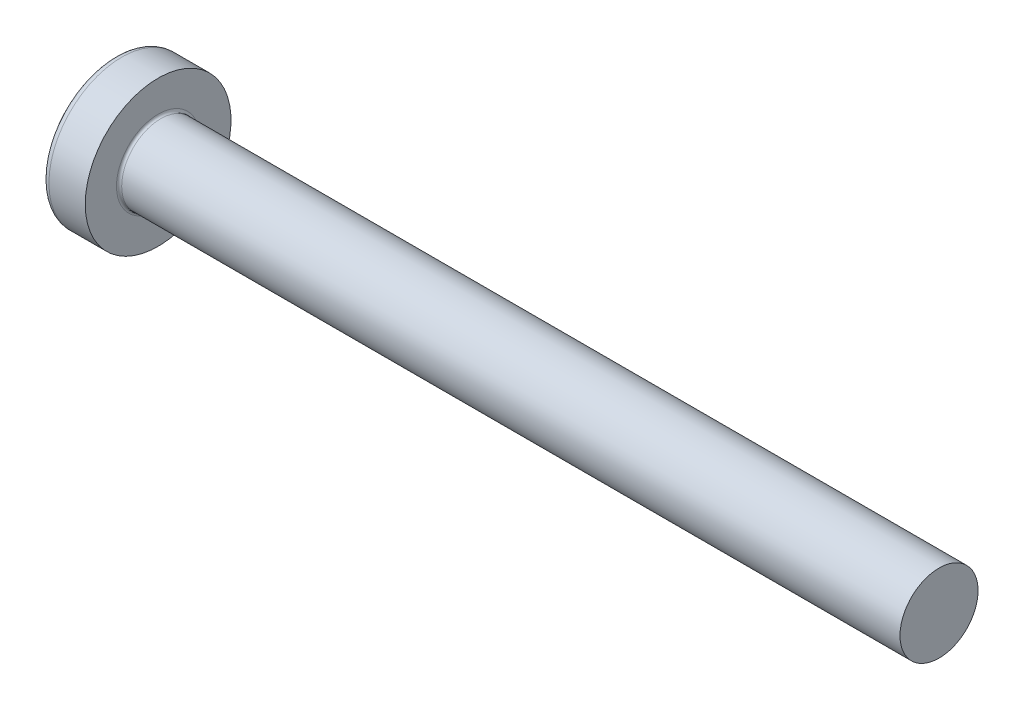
from build123d import *

# Parameters (mm, degrees)
FILLET1_R    = 0.1
RECPAT_COUNT = 2
RECPAT_ANGLE = 90


with BuildPart() as part:
    # BodySke → Base-Revolve (revolve)
    with BuildSketch(Plane.XY, mode=Mode.PRIVATE) as base_revolve_sk:
        with BuildLine():
            Line((2.4, 1.5), (2.4, 2.8))
            Line((2.4, 2.8), (1.003501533, 2.8))
            ThreePointArc((1.003501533, 2.8), (0.873295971, 2.76653015), (0.775371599, 2.674418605))
            ThreePointArc((0.775371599, 2.674418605), (0.197753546, 1.392274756), (0, 0))
            Line((0, 0), (32.4, 0))
            Line((32.4, 0), (32.4, 1.5))
            Line((32.4, 1.5), (2.4, 1.5))
        make_face()
    revolve(base_revolve_sk.sketch.rotate(Axis((1.003501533, 0, 0), (1, 0, 0)), 90), axis=Axis((1.003501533, 0, 0), (1, 0, 0)))

    # Fillet1
    fillet1_edges = [part.edges().sort_by_distance(p)[0] for p in [
        (2.4, 0, -1.5),
    ]]
    fillet(fillet1_edges, radius=FILLET1_R)

    # Sketch3 → Recess section 0
    with BuildSketch(Plane(origin=(0, 0, 0), x_dir=(0, 0, -1), z_dir=(1, 0, 0))):
        with BuildLine():
            Line((0.37, -1.4), (-0.37, -1.4))
            Line((-0.37, -1.4), (-0.37, 1.4))
            Line((-0.37, 1.4), (0.37, 1.4))
            Line((0.37, 1.4), (0.37, -1.4))
        make_face()
    # Sketch4 → Recess section 1
    with BuildSketch(Plane(origin=(1.75, 0, 0), x_dir=(0, 0, -1), z_dir=(1, 0, 0))):
        with BuildLine():
            Line((0.37, -0.527482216), (-0.37, -0.527482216))
            Line((-0.37, -0.527482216), (-0.37, 0.527482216))
            Line((-0.37, 0.527482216), (0.37, 0.527482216))
            Line((0.37, 0.527482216), (0.37, -0.527482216))
        make_face()
    recess = loft(mode=Mode.SUBTRACT)

    # RecPat: Recess ×2 about axis
    recpat_axis = Axis((0, 0, 0), (1, 0, 0))
    for i in range(1, RECPAT_COUNT):
        add(recess.rotate(recpat_axis, i * RECPAT_ANGLE / (RECPAT_COUNT - 1)), mode=Mode.SUBTRACT)

    # RecCorSke → RecessCore (revolve, cut)
    with BuildSketch(Plane.XY, mode=Mode.PRIVATE) as recesscore_sk:
        Polygon((0, 0), (0, 0.678371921), (1.75, 0.556), (1.930655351, 0), align=None)
    revolve(recesscore_sk.sketch.rotate(Axis((-3.175, 0, 0), (1, 0, 0)), 344.185974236), axis=Axis((-3.175, 0, 0), (1, 0, 0)), mode=Mode.SUBTRACT)


solid = part.part
